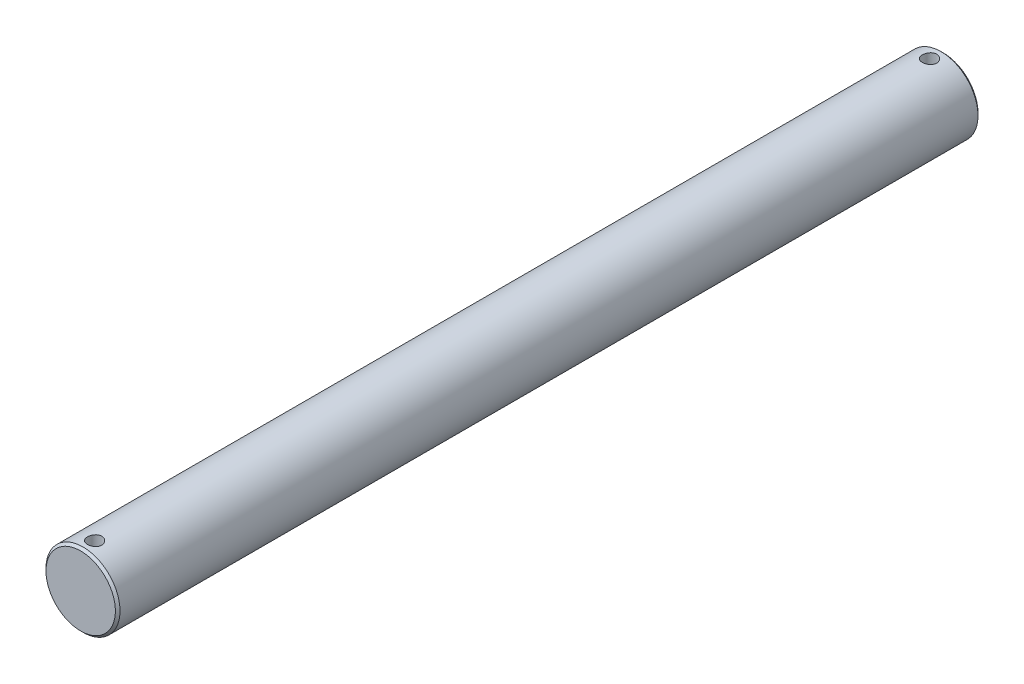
ISO-10303-21;
HEADER;
FILE_DESCRIPTION(('STEP AP214'),'2;1');
FILE_NAME('part.step','',(''),(''),'','','');
FILE_SCHEMA(('AUTOMOTIVE_DESIGN { 1 0 10303 214 1 1 1 1 }'));
ENDSEC;
DATA;
#1=APPLICATION_CONTEXT('core data for automotive mechanical design processes');
#2=APPLICATION_PROTOCOL_DEFINITION('international standard','automotive_design',2000,#1);
#3=PRODUCT_CONTEXT('',#1,'mechanical');
#4=PRODUCT('Part','Part','',(#3));
#5=PRODUCT_RELATED_PRODUCT_CATEGORY('part','',(#4));
#6=PRODUCT_DEFINITION_FORMATION('','',#4);
#7=PRODUCT_DEFINITION_CONTEXT('part definition',#1,'design');
#8=PRODUCT_DEFINITION('design','',#6,#7);
#9=PRODUCT_DEFINITION_SHAPE('','',#8);
#10=(LENGTH_UNIT() NAMED_UNIT(*) SI_UNIT(.MILLI.,.METRE.));
#11=(NAMED_UNIT(*) PLANE_ANGLE_UNIT() SI_UNIT($,.RADIAN.));
#12=(NAMED_UNIT(*) SI_UNIT($,.STERADIAN.) SOLID_ANGLE_UNIT());
#13=UNCERTAINTY_MEASURE_WITH_UNIT(LENGTH_MEASURE(1.E-05),#10,'distance_accuracy_value','');
#14=(GEOMETRIC_REPRESENTATION_CONTEXT(3) GLOBAL_UNCERTAINTY_ASSIGNED_CONTEXT((#13)) GLOBAL_UNIT_ASSIGNED_CONTEXT((#10,
#11,#12)) REPRESENTATION_CONTEXT('',''));
#15=CARTESIAN_POINT('',(0.,0.,0.));
#16=DIRECTION('',(0.,0.,1.));
#17=DIRECTION('',(1.,0.,0.));
#18=AXIS2_PLACEMENT_3D('',#15,#16,#17);
#19=CARTESIAN_POINT('',(7.5,-7.5,-186.5));
#20=DIRECTION('',(0.,0.,-1.));
#21=DIRECTION('',(-1.,0.,0.));
#22=AXIS2_PLACEMENT_3D('',#19,#20,#21);
#23=PLANE('',#22);
#24=CARTESIAN_POINT('',(0.,0.,-186.5));
#25=DIRECTION('',(0.,0.,1.));
#26=DIRECTION('',(1.,0.,0.));
#27=AXIS2_PLACEMENT_3D('',#24,#25,#26);
#28=CIRCLE('',#27,7.5);
#29=CARTESIAN_POINT('',(7.5,0.,-186.5));
#30=VERTEX_POINT('',#29);
#31=EDGE_CURVE('E76',#30,#30,#28,.F.);
#32=ORIENTED_EDGE('',*,*,#31,.T.);
#33=EDGE_LOOP('',(#32));
#34=FACE_BOUND('',#33,.T.);
#35=ADVANCED_FACE('F15',(#34),#23,.T.);
#36=CARTESIAN_POINT('',(0.,0.,-186.5));
#37=DIRECTION('',(0.,0.,1.));
#38=DIRECTION('',(1.,0.,0.));
#39=AXIS2_PLACEMENT_3D('',#36,#37,#38);
#40=CONICAL_SURFACE('',#39,7.5,0.785398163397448);
#41=ORIENTED_EDGE('',*,*,#31,.F.);
#42=EDGE_LOOP('',(#41));
#43=FACE_BOUND('',#42,.T.);
#44=CARTESIAN_POINT('',(0.,0.,-186.));
#45=DIRECTION('',(0.,0.,1.));
#46=DIRECTION('',(1.,0.,0.));
#47=AXIS2_PLACEMENT_3D('',#44,#45,#46);
#48=CIRCLE('',#47,8.);
#49=CARTESIAN_POINT('',(8.,0.,-186.));
#50=VERTEX_POINT('',#49);
#51=EDGE_CURVE('E72',#50,#50,#48,.F.);
#52=ORIENTED_EDGE('',*,*,#51,.T.);
#53=EDGE_LOOP('',(#52));
#54=FACE_BOUND('',#53,.T.);
#55=ADVANCED_FACE('F58',(#43,#54),#40,.T.);
#56=CARTESIAN_POINT('',(0.,-8.,-3.));
#57=DIRECTION('',(0.,1.,0.));
#58=DIRECTION('',(0.,0.,1.));
#59=AXIS2_PLACEMENT_3D('',#56,#57,#58);
#60=CYLINDRICAL_SURFACE('',#59,1.55);
#61=CARTESIAN_POINT('',(0.202299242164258,7.99744177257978,-1.46325831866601));
#62=CARTESIAN_POINT('',(0.26938390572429,7.99574488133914,-1.47208940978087));
#63=CARTESIAN_POINT('',(0.335867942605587,7.99321375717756,-1.48531756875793));
#64=CARTESIAN_POINT('',(0.466534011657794,7.98665328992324,-1.52032923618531));
#65=CARTESIAN_POINT('',(0.530713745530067,7.98262249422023,-1.54212104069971));
#66=CARTESIAN_POINT('',(0.655680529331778,7.97333151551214,-1.59388374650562));
#67=CARTESIAN_POINT('',(0.716463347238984,7.96806983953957,-1.62386458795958));
#68=CARTESIAN_POINT('',(0.833598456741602,7.95666903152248,-1.69149235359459));
#69=CARTESIAN_POINT('',(0.889945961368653,7.95052897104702,-1.72914740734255));
#70=CARTESIAN_POINT('',(0.997247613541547,7.93778434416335,-1.81148268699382));
#71=CARTESIAN_POINT('',(1.04819833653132,7.93117948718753,-1.85616732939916));
#72=CARTESIAN_POINT('',(1.14383347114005,7.91795286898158,-1.95180243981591));
#73=CARTESIAN_POINT('',(1.18851775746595,7.91133110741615,-2.00275303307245));
#74=CARTESIAN_POINT('',(1.27085277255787,7.89852329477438,-2.11005420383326));
#75=CARTESIAN_POINT('',(1.30850763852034,7.89233698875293,-2.16640157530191));
#76=CARTESIAN_POINT('',(1.3761351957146,7.88082669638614,-2.2835362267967));
#77=CARTESIAN_POINT('',(1.40611594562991,7.87550180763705,-2.34431876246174));
#78=CARTESIAN_POINT('',(1.45787851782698,7.86608437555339,-2.46928514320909));
#79=CARTESIAN_POINT('',(1.479670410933,7.86199031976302,-2.5334646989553));
#80=CARTESIAN_POINT('',(1.51468212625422,7.85532028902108,-2.66413087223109));
#81=CARTESIAN_POINT('',(1.52791047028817,7.85274280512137,-2.73061512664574));
#82=CARTESIAN_POINT('',(1.54556592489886,7.84928706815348,-2.86473352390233));
#83=CARTESIAN_POINT('',(1.54999998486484,7.84840747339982,-2.93236671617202));
#84=CARTESIAN_POINT('',(1.54999999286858,7.84840747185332,-3.06763308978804));
#85=CARTESIAN_POINT('',(1.54556594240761,7.84928706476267,-3.13526627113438));
#86=CARTESIAN_POINT('',(1.52791051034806,7.85274279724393,-3.26938464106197));
#87=CARTESIAN_POINT('',(1.51468218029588,7.8553202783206,-3.33586887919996));
#88=CARTESIAN_POINT('',(1.47967050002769,7.86199030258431,-3.4665350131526));
#89=CARTESIAN_POINT('',(1.45787862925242,7.86608435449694,-3.53071454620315));
#90=CARTESIAN_POINT('',(1.40611611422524,7.87550177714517,-3.65568087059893));
#91=CARTESIAN_POINT('',(1.37613540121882,7.88082666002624,-3.71646337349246));
#92=CARTESIAN_POINT('',(1.30850796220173,7.89233693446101,-3.83359790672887));
#93=CARTESIAN_POINT('',(1.27085318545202,7.8985232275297,-3.88994519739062));
#94=CARTESIAN_POINT('',(1.18851817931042,7.91133104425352,-3.9972464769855));
#95=CARTESIAN_POINT('',(1.14383378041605,7.91795282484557,-4.04819723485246));
#96=CARTESIAN_POINT('',(1.04819866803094,7.93117944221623,-4.14383235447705));
#97=CARTESIAN_POINT('',(0.997248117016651,7.93778427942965,-4.18851687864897));
#98=CARTESIAN_POINT('',(0.889946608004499,7.95052889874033,-4.27085214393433));
#99=CARTESIAN_POINT('',(0.833599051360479,7.95666896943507,-4.30850727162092));
#100=CARTESIAN_POINT('',(0.716463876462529,7.9680697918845,-4.37613513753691));
#101=CARTESIAN_POINT('',(0.655681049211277,7.97333147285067,-4.40611601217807));
#102=CARTESIAN_POINT('',(0.530714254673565,7.98262246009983,-4.4578787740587));
#103=CARTESIAN_POINT('',(0.466534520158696,7.98665325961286,-4.47967060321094));
#104=CARTESIAN_POINT('',(0.335868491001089,7.99321373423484,-4.51468230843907));
#105=CARTESIAN_POINT('',(0.269384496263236,7.99574486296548,-4.52791048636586));
#106=CARTESIAN_POINT('',(0.135266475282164,7.99913735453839,-4.54556596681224));
#107=CARTESIAN_POINT('',(0.0676333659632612,7.99999999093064,-4.54999998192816));
#108=CARTESIAN_POINT('',(-0.0676328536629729,7.99999999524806,-4.5500000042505));
#109=CARTESIAN_POINT('',(-0.135265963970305,7.9991373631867,-4.54556601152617));
#110=CARTESIAN_POINT('',(-0.269383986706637,7.995744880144,-4.52791057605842));
#111=CARTESIAN_POINT('',(-0.335867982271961,7.99321375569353,-4.51468242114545));
#112=CARTESIAN_POINT('',(-0.466534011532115,7.98665328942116,-4.47967076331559));
#113=CARTESIAN_POINT('',(-0.530713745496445,7.98262249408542,-4.45787895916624));
#114=CARTESIAN_POINT('',(-0.65568052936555,7.97333151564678,-4.4061162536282));
#115=CARTESIAN_POINT('',(-0.716463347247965,7.96806983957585,-4.37613541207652));
#116=CARTESIAN_POINT('',(-0.833598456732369,7.95666903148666,-4.30850764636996));
#117=CARTESIAN_POINT('',(-0.889945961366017,7.9505289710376,-4.27085259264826));
#118=CARTESIAN_POINT('',(-0.99724761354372,7.93778434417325,-4.18851731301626));
#119=CARTESIAN_POINT('',(-1.0481983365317,7.93117948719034,-4.1438326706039));
#120=CARTESIAN_POINT('',(-1.14383347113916,7.91795286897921,-4.04819756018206));
#121=CARTESIAN_POINT('',(-1.18851775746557,7.91133110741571,-3.99724696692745));
#122=CARTESIAN_POINT('',(-1.27085277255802,7.89852329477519,-3.8899457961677));
#123=CARTESIAN_POINT('',(-1.30850763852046,7.89233698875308,-3.83359842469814));
#124=CARTESIAN_POINT('',(-1.37613519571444,7.88082669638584,-3.716463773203));
#125=CARTESIAN_POINT('',(-1.40611594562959,7.87550180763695,-3.65568123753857));
#126=CARTESIAN_POINT('',(-1.45787851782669,7.8660843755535,-3.53071485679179));
#127=CARTESIAN_POINT('',(-1.47967041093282,7.86199031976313,-3.46653530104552));
#128=CARTESIAN_POINT('',(-1.51468212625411,7.85532028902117,-3.33586912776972));
#129=CARTESIAN_POINT('',(-1.52791047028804,7.85274280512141,-3.26938487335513));
#130=CARTESIAN_POINT('',(-1.54556592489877,7.84928706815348,-3.13526647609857));
#131=CARTESIAN_POINT('',(-1.5499999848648,7.84840747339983,-3.06763328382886));
#132=CARTESIAN_POINT('',(-1.54999999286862,7.84840747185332,-2.93236691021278));
#133=CARTESIAN_POINT('',(-1.54556594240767,7.84928706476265,-2.8647337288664));
#134=CARTESIAN_POINT('',(-1.5279105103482,7.85274279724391,-2.73061535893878));
#135=CARTESIAN_POINT('',(-1.51468218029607,7.8553202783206,-2.66413112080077));
#136=CARTESIAN_POINT('',(-1.4796705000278,7.86199030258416,-2.5334649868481));
#137=CARTESIAN_POINT('',(-1.45787862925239,7.86608435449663,-2.46928545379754));
#138=CARTESIAN_POINT('',(-1.40611611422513,7.87550177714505,-2.34431912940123));
#139=CARTESIAN_POINT('',(-1.37613540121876,7.88082666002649,-2.28353662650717));
#140=CARTESIAN_POINT('',(-1.30850796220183,7.89233693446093,-2.16640209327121));
#141=CARTESIAN_POINT('',(-1.27085318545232,7.89852322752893,-2.11005480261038));
#142=CARTESIAN_POINT('',(-1.18851817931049,7.91133104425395,-2.00275352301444));
#143=CARTESIAN_POINT('',(-1.14383378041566,7.91795282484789,-1.95180276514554));
#144=CARTESIAN_POINT('',(-1.04819866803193,7.9311794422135,-1.856167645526));
#145=CARTESIAN_POINT('',(-0.99724811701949,7.93778427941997,-1.81148312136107));
#146=CARTESIAN_POINT('',(-0.889946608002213,7.95052889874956,-1.72914785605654));
#147=CARTESIAN_POINT('',(-0.833599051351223,7.95666896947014,-1.69149272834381));
#148=CARTESIAN_POINT('',(-0.71646387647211,7.96806979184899,-1.62386486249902));
#149=CARTESIAN_POINT('',(-0.655681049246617,7.97333147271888,-1.59388398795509));
#150=CARTESIAN_POINT('',(-0.530714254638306,7.9826224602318,-1.54212122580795));
#151=CARTESIAN_POINT('',(-0.466534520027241,7.98665326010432,-1.52032939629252));
#152=CARTESIAN_POINT('',(-0.33586857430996,7.99321372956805,-1.48531771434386));
#153=CARTESIAN_POINT('',(-0.269384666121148,7.9957448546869,-1.47208954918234));
#154=CARTESIAN_POINT('',(-0.135266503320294,7.99913735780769,-1.45443402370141));
#155=CARTESIAN_POINT('',(-0.0676331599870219,8.00000000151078,-1.44999999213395));
#156=CARTESIAN_POINT('',(0.0676331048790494,7.99999999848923,-1.45000000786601));
#157=CARTESIAN_POINT('',(0.135266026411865,7.99913736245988,-1.45443400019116));
#158=CARTESIAN_POINT('',(0.202299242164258,7.99744177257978,-1.46325831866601));
#159=B_SPLINE_CURVE_WITH_KNOTS('',3,(#61,#62,#63,#64,#65,#66,#67,#68,#69,#70,#71,#72,#73,#74,
#75,#76,#77,#78,#79,#80,#81,#82,#83,#84,#85,#86,#87,#88,#89,#90,#91,#92,#93,#94,#95,#96,#97,#98,
#99,#100,#101,#102,#103,#104,#105,#106,#107,#108,#109,#110,#111,#112,#113,#114,#115,#116,#117,
#118,#119,#120,#121,#122,#123,#124,#125,#126,#127,#128,#129,#130,#131,#132,#133,#134,#135,#136,
#137,#138,#139,#140,#141,#142,#143,#144,#145,#146,#147,#148,#149,#150,#151,#152,#153,#154,#155,
#156,#157,#158),.UNSPECIFIED.,.T.,.F.,(4,2,2,2,2,2,2,2,2,2,2,2,2,2,2,2,2,2,2,2,2,2,2,2,2,2,2,2,
2,2,2,2,2,2,2,2,2,2,2,2,2,2,2,2,2,2,2,2,4),(0.,0.202904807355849,0.406006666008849,
0.609356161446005,0.812922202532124,1.01661665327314,1.22031517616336,1.42389343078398,
1.6272570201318,1.83036968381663,2.03327991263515,2.23602973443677,2.4387795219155,
2.64168969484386,2.84480227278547,3.04816572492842,3.2517436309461,3.45544274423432,
3.65913657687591,3.86270286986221,4.0660524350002,4.26915431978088,4.47205901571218,
4.67480877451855,4.87755853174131,5.0804632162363,5.28356507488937,5.48691457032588,
5.69048061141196,5.89417506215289,6.09787358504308,6.30145183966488,6.50481542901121,
6.7079280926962,6.91083832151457,7.11358814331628,7.31633793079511,7.51924810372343,
7.72236068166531,7.92572413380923,8.1293020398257,8.33300115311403,8.53669498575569,
8.74026127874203,8.94361084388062,9.14671272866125,9.34961716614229,9.55236762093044,
9.75511681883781),.UNSPECIFIED.);
#160=CARTESIAN_POINT('',(0.202299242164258,7.99744177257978,-1.46325831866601));
#161=VERTEX_POINT('',#160);
#162=EDGE_CURVE('E65',#161,#161,#159,.T.);
#163=ORIENTED_EDGE('',*,*,#162,.T.);
#164=EDGE_LOOP('',(#163));
#165=FACE_BOUND('',#164,.T.);
#166=CARTESIAN_POINT('',(-0.202299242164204,-7.99744177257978,-1.463258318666));
#167=CARTESIAN_POINT('',(-0.269383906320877,-7.99574488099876,-1.47208941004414));
#168=CARTESIAN_POINT('',(-0.335867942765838,-7.99321375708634,-1.48531756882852));
#169=CARTESIAN_POINT('',(-0.466534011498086,-7.98665329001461,-1.52032923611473));
#170=CARTESIAN_POINT('',(-0.53071374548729,-7.98262249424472,-1.54212104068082));
#171=CARTESIAN_POINT('',(-0.655680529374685,-7.9733315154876,-1.59388374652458));
#172=CARTESIAN_POINT('',(-0.716463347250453,-7.96806983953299,-1.62386458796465));
#173=CARTESIAN_POINT('',(-0.833598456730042,-7.95666903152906,-1.69149235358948));
#174=CARTESIAN_POINT('',(-0.889945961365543,-7.95052897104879,-1.72914740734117));
#175=CARTESIAN_POINT('',(-0.997247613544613,-7.93778434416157,-1.81148268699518));
#176=CARTESIAN_POINT('',(-1.0481983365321,-7.93117948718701,-1.85616732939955));
#177=CARTESIAN_POINT('',(-1.14383347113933,-7.91795286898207,-1.95180243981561));
#178=CARTESIAN_POINT('',(-1.18851775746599,-7.91133110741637,-2.00275303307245));
#179=CARTESIAN_POINT('',(-1.27085277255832,-7.89852329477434,-2.11005420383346));
#180=CARTESIAN_POINT('',(-1.30850763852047,-7.89233698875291,-2.166401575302));
#181=CARTESIAN_POINT('',(-1.37613519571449,-7.88082669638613,-2.28353622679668));
#182=CARTESIAN_POINT('',(-1.40611594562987,-7.87550180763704,-2.34431876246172));
#183=CARTESIAN_POINT('',(-1.45787851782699,-7.86608437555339,-2.46928514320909));
#184=CARTESIAN_POINT('',(-1.47967041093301,-7.86199031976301,-2.53346469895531));
#185=CARTESIAN_POINT('',(-1.51468212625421,-7.85532028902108,-2.6641308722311));
#186=CARTESIAN_POINT('',(-1.52791047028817,-7.85274280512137,-2.73061512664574));
#187=CARTESIAN_POINT('',(-1.54556592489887,-7.84928706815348,-2.86473352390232));
#188=CARTESIAN_POINT('',(-1.54999998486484,-7.84840747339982,-2.93236671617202));
#189=CARTESIAN_POINT('',(-1.54999999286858,-7.84840747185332,-3.06763308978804));
#190=CARTESIAN_POINT('',(-1.54556594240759,-7.84928706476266,-3.13526627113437));
#191=CARTESIAN_POINT('',(-1.52791051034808,-7.85274279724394,-3.26938464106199));
#192=CARTESIAN_POINT('',(-1.51468218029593,-7.85532027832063,-3.33586887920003));
#193=CARTESIAN_POINT('',(-1.47967050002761,-7.86199030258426,-3.4665350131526));
#194=CARTESIAN_POINT('',(-1.45787862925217,-7.86608435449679,-3.53071454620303));
#195=CARTESIAN_POINT('',(-1.40611611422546,-7.87550177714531,-3.65568087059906));
#196=CARTESIAN_POINT('',(-1.37613540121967,-7.88082666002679,-3.71646337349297));
#197=CARTESIAN_POINT('',(-1.3085079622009,-7.89233693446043,-3.83359790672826));
#198=CARTESIAN_POINT('',(-1.2708531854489,-7.89852322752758,-3.88994519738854));
#199=CARTESIAN_POINT('',(-1.18851817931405,-7.91133104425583,-3.99724647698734));
#200=CARTESIAN_POINT('',(-1.14383378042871,-7.91795282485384,-4.04819723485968));
#201=CARTESIAN_POINT('',(-1.04819866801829,-7.93117944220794,-4.1438323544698));
#202=CARTESIAN_POINT('',(-0.997248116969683,-7.93778427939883,-4.18851687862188));
#203=CARTESIAN_POINT('',(-0.889946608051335,-7.95052889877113,-4.27085214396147));
#204=CARTESIAN_POINT('',(-0.833599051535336,-7.95666896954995,-4.30850727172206));
#205=CARTESIAN_POINT('',(-0.716463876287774,-7.96806979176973,-4.37613513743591));
#206=CARTESIAN_POINT('',(-0.655681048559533,-7.97333147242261,-4.40611601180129));
#207=CARTESIAN_POINT('',(-0.530714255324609,-7.98262246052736,-4.45787877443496));
#208=CARTESIAN_POINT('',(-0.466534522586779,-7.98665326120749,-4.47967060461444));
#209=CARTESIAN_POINT('',(-0.335866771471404,-7.9932138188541,-4.51468276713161));
#210=CARTESIAN_POINT('',(-0.269380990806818,-7.99574499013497,-4.52791117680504));
#211=CARTESIAN_POINT('',(-0.135262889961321,-7.99913739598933,-4.54556619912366));
#212=CARTESIAN_POINT('',(-0.0676315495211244,-7.99999999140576,-4.54999998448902));
#213=CARTESIAN_POINT('',(0.0676328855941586,-7.99999999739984,-4.55000000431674));
#214=CARTESIAN_POINT('',(0.135265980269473,-7.99913736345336,-4.54556600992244));
#215=CARTESIAN_POINT('',(0.269383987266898,-7.99574487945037,-4.52791057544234));
#216=CARTESIAN_POINT('',(0.335867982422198,-7.99321375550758,-4.51468242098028));
#217=CARTESIAN_POINT('',(0.466534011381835,-7.9866532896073,-4.47967076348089));
#218=CARTESIAN_POINT('',(0.530713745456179,-7.98262249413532,-4.45787895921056));
#219=CARTESIAN_POINT('',(0.655680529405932,-7.97333151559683,-4.40611625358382));
#220=CARTESIAN_POINT('',(0.716463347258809,-7.96806983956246,-4.37613541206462));
#221=CARTESIAN_POINT('',(0.833598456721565,-7.95666903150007,-4.30850764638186));
#222=CARTESIAN_POINT('',(0.889945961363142,-7.9505289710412,-4.27085259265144));
#223=CARTESIAN_POINT('',(0.997247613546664,-7.93778434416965,-4.18851731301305));
#224=CARTESIAN_POINT('',(1.04819833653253,-7.93117948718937,-4.14383267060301));
#225=CARTESIAN_POINT('',(1.14383347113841,-7.91795286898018,-4.04819756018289));
#226=CARTESIAN_POINT('',(1.18851775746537,-7.91133110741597,-3.99724696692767));
#227=CARTESIAN_POINT('',(1.27085277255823,-7.89852329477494,-3.88994579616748));
#228=CARTESIAN_POINT('',(1.30850763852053,-7.89233698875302,-3.83359842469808));
#229=CARTESIAN_POINT('',(1.3761351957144,-7.88082669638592,-3.71646377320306));
#230=CARTESIAN_POINT('',(1.40611594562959,-7.87550180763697,-3.65568123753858));
#231=CARTESIAN_POINT('',(1.45787851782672,-7.86608437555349,-3.53071485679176));
#232=CARTESIAN_POINT('',(1.47967041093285,-7.86199031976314,-3.46653530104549));
#233=CARTESIAN_POINT('',(1.51468212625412,-7.85532028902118,-3.33586912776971));
#234=CARTESIAN_POINT('',(1.52791047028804,-7.85274280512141,-3.26938487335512));
#235=CARTESIAN_POINT('',(1.54556592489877,-7.84928706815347,-3.13526647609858));
#236=CARTESIAN_POINT('',(1.5499999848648,-7.84840747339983,-3.06763328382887));
#237=CARTESIAN_POINT('',(1.54999999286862,-7.84840747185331,-2.93236691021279));
#238=CARTESIAN_POINT('',(1.54556594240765,-7.84928706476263,-2.86473372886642));
#239=CARTESIAN_POINT('',(1.52791051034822,-7.85274279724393,-2.73061535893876));
#240=CARTESIAN_POINT('',(1.51468218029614,-7.85532027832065,-2.66413112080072));
#241=CARTESIAN_POINT('',(1.47967050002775,-7.86199030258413,-2.53346498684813));
#242=CARTESIAN_POINT('',(1.45787862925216,-7.86608435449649,-2.46928545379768));
#243=CARTESIAN_POINT('',(1.4061161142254,-7.8755017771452,-2.34431912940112));
#244=CARTESIAN_POINT('',(1.37613540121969,-7.88082666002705,-2.28353662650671));
#245=CARTESIAN_POINT('',(1.30850796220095,-7.89233693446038,-2.16640209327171));
#246=CARTESIAN_POINT('',(1.27085318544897,-7.89852322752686,-2.1100548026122));
#247=CARTESIAN_POINT('',(1.18851817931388,-7.91133104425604,-2.00275352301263));
#248=CARTESIAN_POINT('',(1.14383378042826,-7.91795282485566,-1.95180276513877));
#249=CARTESIAN_POINT('',(1.04819866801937,-7.93117944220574,-1.85616764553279));
#250=CARTESIAN_POINT('',(0.997248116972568,-7.93778427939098,-1.81148312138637));
#251=CARTESIAN_POINT('',(0.889946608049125,-7.95052889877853,-1.72914785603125));
#252=CARTESIAN_POINT('',(0.83359905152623,-7.95666896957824,-1.69149272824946));
#253=CARTESIAN_POINT('',(0.716463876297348,-7.96806979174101,-1.62386486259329));
#254=CARTESIAN_POINT('',(0.655681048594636,-7.97333147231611,-1.5938839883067));
#255=CARTESIAN_POINT('',(0.53071425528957,-7.98262246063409,-1.54212122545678));
#256=CARTESIAN_POINT('',(0.466534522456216,-7.98665326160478,-1.5203293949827));
#257=CARTESIAN_POINT('',(0.335866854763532,-7.99321381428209,-1.48531725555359));
#258=CARTESIAN_POINT('',(0.269381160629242,-7.9957449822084,-1.47208885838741));
#259=CARTESIAN_POINT('',(0.13526293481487,-7.99913739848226,-1.45443379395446));
#260=CARTESIAN_POINT('',(0.0676313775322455,-8.00000000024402,-1.44999999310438));
#261=CARTESIAN_POINT('',(-0.0676331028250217,-7.99999999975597,-1.45000000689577));
#262=CARTESIAN_POINT('',(-0.135266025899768,-7.99913736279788,-1.45443399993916));
#263=CARTESIAN_POINT('',(-0.202299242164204,-7.99744177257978,-1.463258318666));
#264=B_SPLINE_CURVE_WITH_KNOTS('',3,(#166,#167,#168,#169,#170,#171,#172,#173,#174,#175,#176,
#177,#178,#179,#180,#181,#182,#183,#184,#185,#186,#187,#188,#189,#190,#191,#192,#193,#194,#195,
#196,#197,#198,#199,#200,#201,#202,#203,#204,#205,#206,#207,#208,#209,#210,#211,#212,#213,#214,
#215,#216,#217,#218,#219,#220,#221,#222,#223,#224,#225,#226,#227,#228,#229,#230,#231,#232,#233,
#234,#235,#236,#237,#238,#239,#240,#241,#242,#243,#244,#245,#246,#247,#248,#249,#250,#251,#252,
#253,#254,#255,#256,#257,#258,#259,#260,#261,#262,#263),.UNSPECIFIED.,.T.,.F.,(4,2,2,2,2,2,2,2,
2,2,2,2,2,2,2,2,2,2,2,2,2,2,2,2,2,2,2,2,2,2,2,2,2,2,2,2,2,2,2,2,2,2,2,2,2,2,2,2,4),(0.,
0.202904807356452,0.406006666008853,0.609356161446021,0.812922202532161,1.0166166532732,
1.22031517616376,1.42389343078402,1.62725702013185,1.83036968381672,2.03327991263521,
2.23602973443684,2.43877952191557,2.64168969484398,2.84480227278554,3.0481657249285,
3.25174363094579,3.45544274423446,3.65913657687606,3.86270286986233,4.06605243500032,
4.26915431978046,4.47206435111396,4.67480882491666,4.87755853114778,5.0804632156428,
5.28356507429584,5.48691456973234,5.69048061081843,5.89417506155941,6.09787358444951,
6.30145183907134,6.50481542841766,6.70792809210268,6.91083832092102,7.11358814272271,
7.31633793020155,7.5192481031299,7.72236068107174,7.92572413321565,8.12930203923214,
8.33300115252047,8.53669498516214,8.74026127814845,8.94361084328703,9.1467127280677,
9.34962250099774,9.55236761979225,9.75511681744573),.UNSPECIFIED.);
#265=CARTESIAN_POINT('',(-0.202299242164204,-7.99744177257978,-1.463258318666));
#266=VERTEX_POINT('',#265);
#267=EDGE_CURVE('E62',#266,#266,#264,.T.);
#268=ORIENTED_EDGE('',*,*,#267,.T.);
#269=EDGE_LOOP('',(#268));
#270=FACE_BOUND('',#269,.T.);
#271=ADVANCED_FACE('F52',(#165,#270),#60,.F.);
#272=CARTESIAN_POINT('',(0.,-8.,-183.5));
#273=DIRECTION('',(0.,1.,0.));
#274=DIRECTION('',(0.,0.,1.));
#275=AXIS2_PLACEMENT_3D('',#272,#273,#274);
#276=CYLINDRICAL_SURFACE('',#275,1.54999999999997);
#277=CARTESIAN_POINT('',(0.202299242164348,7.99744177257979,-181.963258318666));
#278=CARTESIAN_POINT('',(0.269383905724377,7.99574488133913,-181.972089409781));
#279=CARTESIAN_POINT('',(0.335867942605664,7.99321375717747,-181.985317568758));
#280=CARTESIAN_POINT('',(0.466534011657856,7.98665328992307,-182.020329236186));
#281=CARTESIAN_POINT('',(0.530713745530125,7.98262249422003,-182.0421210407));
#282=CARTESIAN_POINT('',(0.655680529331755,7.97333151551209,-182.093883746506));
#283=CARTESIAN_POINT('',(0.716463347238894,7.9680698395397,-182.123864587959));
#284=CARTESIAN_POINT('',(0.833598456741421,7.95666903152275,-182.191492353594));
#285=CARTESIAN_POINT('',(0.889945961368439,7.95052897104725,-182.229147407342));
#286=CARTESIAN_POINT('',(0.997247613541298,7.93778434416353,-182.311482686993));
#287=CARTESIAN_POINT('',(1.04819833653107,7.93117948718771,-182.356167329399));
#288=CARTESIAN_POINT('',(1.14383347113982,7.91795286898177,-182.451802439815));
#289=CARTESIAN_POINT('',(1.18851775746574,7.91133110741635,-182.502753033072));
#290=CARTESIAN_POINT('',(1.27085277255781,7.89852329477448,-182.610054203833));
#291=CARTESIAN_POINT('',(1.30850763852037,7.89233698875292,-182.666401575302));
#292=CARTESIAN_POINT('',(1.37613519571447,7.88082669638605,-182.783536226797));
#293=CARTESIAN_POINT('',(1.4061159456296,7.87550180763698,-182.844318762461));
#294=CARTESIAN_POINT('',(1.45787851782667,7.86608437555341,-182.969285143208));
#295=CARTESIAN_POINT('',(1.47967041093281,7.8619903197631,-183.033464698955));
#296=CARTESIAN_POINT('',(1.51468212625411,7.85532028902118,-183.16413087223));
#297=CARTESIAN_POINT('',(1.52791047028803,7.85274280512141,-183.230615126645));
#298=CARTESIAN_POINT('',(1.54556592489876,7.84928706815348,-183.364733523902));
#299=CARTESIAN_POINT('',(1.54999998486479,7.84840747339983,-183.432366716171));
#300=CARTESIAN_POINT('',(1.54999999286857,7.84840747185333,-183.567633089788));
#301=CARTESIAN_POINT('',(1.54556594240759,7.84928706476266,-183.635266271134));
#302=CARTESIAN_POINT('',(1.52791051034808,7.85274279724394,-183.769384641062));
#303=CARTESIAN_POINT('',(1.51468218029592,7.85532027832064,-183.8358688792));
#304=CARTESIAN_POINT('',(1.47967050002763,7.86199030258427,-183.966535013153));
#305=CARTESIAN_POINT('',(1.45787862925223,7.86608435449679,-184.030714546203));
#306=CARTESIAN_POINT('',(1.40611611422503,7.87550177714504,-184.155680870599));
#307=CARTESIAN_POINT('',(1.37613540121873,7.88082666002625,-184.216463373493));
#308=CARTESIAN_POINT('',(1.30850796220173,7.89233693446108,-184.333597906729));
#309=CARTESIAN_POINT('',(1.27085318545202,7.89852322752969,-184.389945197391));
#310=CARTESIAN_POINT('',(1.18851817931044,7.91133104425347,-184.497246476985));
#311=CARTESIAN_POINT('',(1.14383378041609,7.91795282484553,-184.548197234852));
#312=CARTESIAN_POINT('',(1.04819866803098,7.93117944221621,-184.643832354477));
#313=CARTESIAN_POINT('',(0.997248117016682,7.93778427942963,-184.688516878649));
#314=CARTESIAN_POINT('',(0.889946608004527,7.95052889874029,-184.770852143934));
#315=CARTESIAN_POINT('',(0.833599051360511,7.95666896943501,-184.808507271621));
#316=CARTESIAN_POINT('',(0.716463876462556,7.96806979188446,-184.876135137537));
#317=CARTESIAN_POINT('',(0.655681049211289,7.97333147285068,-184.906116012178));
#318=CARTESIAN_POINT('',(0.530714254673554,7.98262246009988,-184.957878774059));
#319=CARTESIAN_POINT('',(0.466534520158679,7.98665325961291,-184.979670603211));
#320=CARTESIAN_POINT('',(0.335868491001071,7.99321373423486,-185.014682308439));
#321=CARTESIAN_POINT('',(0.269384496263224,7.99574486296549,-185.027910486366));
#322=CARTESIAN_POINT('',(0.135266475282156,7.99913735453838,-185.045565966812));
#323=CARTESIAN_POINT('',(0.0676333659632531,7.99999999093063,-185.049999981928));
#324=CARTESIAN_POINT('',(-0.0676328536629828,7.99999999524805,-185.05000000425));
#325=CARTESIAN_POINT('',(-0.135265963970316,7.9991373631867,-185.045566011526));
#326=CARTESIAN_POINT('',(-0.269383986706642,7.99574488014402,-185.027910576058));
#327=CARTESIAN_POINT('',(-0.335867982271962,7.99321375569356,-185.014682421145));
#328=CARTESIAN_POINT('',(-0.466534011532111,7.98665328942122,-184.979670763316));
#329=CARTESIAN_POINT('',(-0.530713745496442,7.98262249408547,-184.957878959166));
#330=CARTESIAN_POINT('',(-0.655680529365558,7.97333151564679,-184.906116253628));
#331=CARTESIAN_POINT('',(-0.716463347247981,7.96806983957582,-184.876135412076));
#332=CARTESIAN_POINT('',(-0.833598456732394,7.9566690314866,-184.80850764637));
#333=CARTESIAN_POINT('',(-0.889945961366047,7.95052897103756,-184.770852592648));
#334=CARTESIAN_POINT('',(-0.997247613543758,7.93778434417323,-184.688517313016));
#335=CARTESIAN_POINT('',(-1.04819833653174,7.93117948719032,-184.643832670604));
#336=CARTESIAN_POINT('',(-1.14383347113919,7.91795286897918,-184.548197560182));
#337=CARTESIAN_POINT('',(-1.1885177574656,7.91133110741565,-184.497246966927));
#338=CARTESIAN_POINT('',(-1.27085277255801,7.89852329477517,-184.389945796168));
#339=CARTESIAN_POINT('',(-1.30850763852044,7.89233698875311,-184.333598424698));
#340=CARTESIAN_POINT('',(-1.37613519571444,7.88082669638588,-184.216463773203));
#341=CARTESIAN_POINT('',(-1.4061159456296,7.87550180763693,-184.155681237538));
#342=CARTESIAN_POINT('',(-1.45787851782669,7.86608437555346,-184.030714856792));
#343=CARTESIAN_POINT('',(-1.47967041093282,7.86199031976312,-183.966535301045));
#344=CARTESIAN_POINT('',(-1.51468212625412,7.85532028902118,-183.83586912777));
#345=CARTESIAN_POINT('',(-1.52791047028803,7.85274280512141,-183.769384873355));
#346=CARTESIAN_POINT('',(-1.54556592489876,7.84928706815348,-183.635266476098));
#347=CARTESIAN_POINT('',(-1.54999998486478,7.84840747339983,-183.567633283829));
#348=CARTESIAN_POINT('',(-1.54999999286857,7.84840747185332,-183.432366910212));
#349=CARTESIAN_POINT('',(-1.54556594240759,7.84928706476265,-183.364733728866));
#350=CARTESIAN_POINT('',(-1.52791051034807,7.85274279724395,-183.230615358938));
#351=CARTESIAN_POINT('',(-1.51468218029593,7.85532027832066,-183.1641311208));
#352=CARTESIAN_POINT('',(-1.47967050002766,7.86199030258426,-183.033464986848));
#353=CARTESIAN_POINT('',(-1.45787862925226,7.86608435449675,-182.969285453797));
#354=CARTESIAN_POINT('',(-1.40611611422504,7.87550177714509,-182.844319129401));
#355=CARTESIAN_POINT('',(-1.37613540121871,7.88082666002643,-182.783536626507));
#356=CARTESIAN_POINT('',(-1.30850796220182,7.89233693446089,-182.666402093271));
#357=CARTESIAN_POINT('',(-1.27085318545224,7.89852322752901,-182.61005480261));
#358=CARTESIAN_POINT('',(-1.18851817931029,7.91133104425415,-182.502753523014));
#359=CARTESIAN_POINT('',(-1.14383378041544,7.91795282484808,-182.451802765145));
#360=CARTESIAN_POINT('',(-1.04819866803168,7.93117944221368,-182.356167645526));
#361=CARTESIAN_POINT('',(-0.997248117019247,7.93778427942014,-182.311483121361));
#362=CARTESIAN_POINT('',(-0.889946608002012,7.95052889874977,-182.229147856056));
#363=CARTESIAN_POINT('',(-0.83359905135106,7.9566689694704,-182.191492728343));
#364=CARTESIAN_POINT('',(-0.716463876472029,7.96806979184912,-182.123864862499));
#365=CARTESIAN_POINT('',(-0.655681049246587,7.97333147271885,-182.093883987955));
#366=CARTESIAN_POINT('',(-0.530714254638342,7.98262246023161,-182.042121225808));
#367=CARTESIAN_POINT('',(-0.46653452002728,7.98665326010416,-182.020329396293));
#368=CARTESIAN_POINT('',(-0.335868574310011,7.99321372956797,-181.985317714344));
#369=CARTESIAN_POINT('',(-0.269384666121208,7.99574485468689,-181.972089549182));
#370=CARTESIAN_POINT('',(-0.135266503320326,7.99913735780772,-181.954434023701));
#371=CARTESIAN_POINT('',(-0.0676331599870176,8.00000000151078,-181.949999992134));
#372=CARTESIAN_POINT('',(0.0676331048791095,7.99999999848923,-181.950000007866));
#373=CARTESIAN_POINT('',(0.135266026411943,7.9991373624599,-181.954434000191));
#374=CARTESIAN_POINT('',(0.202299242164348,7.99744177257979,-181.963258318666));
#375=B_SPLINE_CURVE_WITH_KNOTS('',3,(#277,#278,#279,#280,#281,#282,#283,#284,#285,#286,#287,
#288,#289,#290,#291,#292,#293,#294,#295,#296,#297,#298,#299,#300,#301,#302,#303,#304,#305,#306,
#307,#308,#309,#310,#311,#312,#313,#314,#315,#316,#317,#318,#319,#320,#321,#322,#323,#324,#325,
#326,#327,#328,#329,#330,#331,#332,#333,#334,#335,#336,#337,#338,#339,#340,#341,#342,#343,#344,
#345,#346,#347,#348,#349,#350,#351,#352,#353,#354,#355,#356,#357,#358,#359,#360,#361,#362,#363,
#364,#365,#366,#367,#368,#369,#370,#371,#372,#373,#374),.UNSPECIFIED.,.T.,.F.,(4,2,2,2,2,2,2,2,
2,2,2,2,2,2,2,2,2,2,2,2,2,2,2,2,2,2,2,2,2,2,2,2,2,2,2,2,2,2,2,2,2,2,2,2,2,2,2,2,4),(0.,
0.202904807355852,0.406006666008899,0.609356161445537,0.812922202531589,1.01661665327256,
1.22031517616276,1.42389343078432,1.62725702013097,1.83036968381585,2.03327991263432,
2.23602973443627,2.43877952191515,2.64168969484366,2.84480227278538,3.04816572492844,
3.2517436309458,3.45544274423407,3.65913657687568,3.86270286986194,4.06605243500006,
4.26915431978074,4.47205901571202,4.67480877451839,4.87755853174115,5.08046321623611,
5.28356507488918,5.48691457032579,5.69048061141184,5.89417506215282,6.09787358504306,
6.30145183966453,6.5048154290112,6.70792809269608,6.91083832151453,7.11358814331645,
7.31633793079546,7.51924810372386,7.72236068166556,7.92572413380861,8.12930203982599,
8.3330011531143,8.5366949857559,8.74026127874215,8.94361084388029,9.14671272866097,
9.34961716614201,9.55236762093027,9.75511681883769),.UNSPECIFIED.);
#376=CARTESIAN_POINT('',(0.202299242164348,7.99744177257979,-181.963258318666));
#377=VERTEX_POINT('',#376);
#378=EDGE_CURVE('E41',#377,#377,#375,.T.);
#379=ORIENTED_EDGE('',*,*,#378,.T.);
#380=EDGE_LOOP('',(#379));
#381=FACE_BOUND('',#380,.T.);
#382=CARTESIAN_POINT('',(-0.202299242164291,-7.99744177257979,-181.963258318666));
#383=CARTESIAN_POINT('',(-0.269383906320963,-7.99574488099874,-181.972089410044));
#384=CARTESIAN_POINT('',(-0.335867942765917,-7.99321375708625,-181.985317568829));
#385=CARTESIAN_POINT('',(-0.46653401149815,-7.98665329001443,-182.020329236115));
#386=CARTESIAN_POINT('',(-0.530713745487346,-7.98262249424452,-182.042121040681));
#387=CARTESIAN_POINT('',(-0.655680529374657,-7.97333151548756,-182.093883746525));
#388=CARTESIAN_POINT('',(-0.71646334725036,-7.96806983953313,-182.123864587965));
#389=CARTESIAN_POINT('',(-0.833598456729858,-7.95666903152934,-182.191492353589));
#390=CARTESIAN_POINT('',(-0.889945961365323,-7.95052897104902,-182.229147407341));
#391=CARTESIAN_POINT('',(-0.997247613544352,-7.93778434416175,-182.311482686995));
#392=CARTESIAN_POINT('',(-1.04819833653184,-7.9311794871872,-182.356167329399));
#393=CARTESIAN_POINT('',(-1.14383347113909,-7.91795286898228,-182.451802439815));
#394=CARTESIAN_POINT('',(-1.18851775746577,-7.91133110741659,-182.502753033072));
#395=CARTESIAN_POINT('',(-1.27085277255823,-7.89852329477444,-182.610054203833));
#396=CARTESIAN_POINT('',(-1.30850763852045,-7.89233698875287,-182.666401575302));
#397=CARTESIAN_POINT('',(-1.37613519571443,-7.88082669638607,-182.783536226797));
#398=CARTESIAN_POINT('',(-1.40611594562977,-7.87550180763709,-182.844318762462));
#399=CARTESIAN_POINT('',(-1.45787851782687,-7.86608437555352,-182.969285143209));
#400=CARTESIAN_POINT('',(-1.47967041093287,-7.86199031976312,-183.033464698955));
#401=CARTESIAN_POINT('',(-1.51468212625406,-7.85532028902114,-183.16413087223));
#402=CARTESIAN_POINT('',(-1.52791047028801,-7.85274280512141,-183.230615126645));
#403=CARTESIAN_POINT('',(-1.54556592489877,-7.84928706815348,-183.364733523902));
#404=CARTESIAN_POINT('',(-1.54999998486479,-7.84840747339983,-183.432366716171));
#405=CARTESIAN_POINT('',(-1.54999999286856,-7.84840747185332,-183.567633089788));
#406=CARTESIAN_POINT('',(-1.54556594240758,-7.84928706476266,-183.635266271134));
#407=CARTESIAN_POINT('',(-1.52791051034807,-7.85274279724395,-183.769384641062));
#408=CARTESIAN_POINT('',(-1.51468218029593,-7.85532027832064,-183.8358688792));
#409=CARTESIAN_POINT('',(-1.47967050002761,-7.86199030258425,-183.966535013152));
#410=CARTESIAN_POINT('',(-1.45787862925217,-7.86608435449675,-184.030714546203));
#411=CARTESIAN_POINT('',(-1.40611611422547,-7.87550177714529,-184.155680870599));
#412=CARTESIAN_POINT('',(-1.37613540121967,-7.88082666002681,-184.216463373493));
#413=CARTESIAN_POINT('',(-1.30850796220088,-7.89233693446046,-184.333597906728));
#414=CARTESIAN_POINT('',(-1.2708531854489,-7.89852322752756,-184.389945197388));
#415=CARTESIAN_POINT('',(-1.18851817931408,-7.91133104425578,-184.497246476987));
#416=CARTESIAN_POINT('',(-1.14383378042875,-7.91795282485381,-184.54819723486));
#417=CARTESIAN_POINT('',(-1.04819866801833,-7.93117944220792,-184.64383235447));
#418=CARTESIAN_POINT('',(-0.997248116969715,-7.93778427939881,-184.688516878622));
#419=CARTESIAN_POINT('',(-0.889946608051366,-7.95052889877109,-184.770852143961));
#420=CARTESIAN_POINT('',(-0.833599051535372,-7.95666896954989,-184.808507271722));
#421=CARTESIAN_POINT('',(-0.716463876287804,-7.9680697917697,-184.876135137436));
#422=CARTESIAN_POINT('',(-0.655681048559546,-7.97333147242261,-184.906116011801));
#423=CARTESIAN_POINT('',(-0.530714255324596,-7.98262246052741,-184.957878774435));
#424=CARTESIAN_POINT('',(-0.466534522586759,-7.98665326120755,-184.979670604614));
#425=CARTESIAN_POINT('',(-0.335866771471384,-7.99321381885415,-185.014682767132));
#426=CARTESIAN_POINT('',(-0.269380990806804,-7.99574499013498,-185.027911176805));
#427=CARTESIAN_POINT('',(-0.135262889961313,-7.99913739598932,-185.045566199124));
#428=CARTESIAN_POINT('',(-0.0676315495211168,-7.99999999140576,-185.049999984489));
#429=CARTESIAN_POINT('',(0.0676328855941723,-7.99999999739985,-185.050000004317));
#430=CARTESIAN_POINT('',(0.135265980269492,-7.99913736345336,-185.045566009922));
#431=CARTESIAN_POINT('',(0.269383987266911,-7.99574487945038,-185.027910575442));
#432=CARTESIAN_POINT('',(0.3358679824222,-7.99321375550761,-185.01468242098));
#433=CARTESIAN_POINT('',(0.466534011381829,-7.98665328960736,-184.979670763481));
#434=CARTESIAN_POINT('',(0.530713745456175,-7.98262249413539,-184.957878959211));
#435=CARTESIAN_POINT('',(0.655680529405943,-7.97333151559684,-184.906116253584));
#436=CARTESIAN_POINT('',(0.71646334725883,-7.96806983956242,-184.876135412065));
#437=CARTESIAN_POINT('',(0.833598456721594,-7.95666903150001,-184.808507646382));
#438=CARTESIAN_POINT('',(0.889945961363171,-7.95052897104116,-184.770852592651));
#439=CARTESIAN_POINT('',(0.997247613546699,-7.93778434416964,-184.688517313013));
#440=CARTESIAN_POINT('',(1.04819833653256,-7.93117948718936,-184.643832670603));
#441=CARTESIAN_POINT('',(1.14383347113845,-7.91795286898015,-184.548197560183));
#442=CARTESIAN_POINT('',(1.1885177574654,-7.91133110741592,-184.497246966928));
#443=CARTESIAN_POINT('',(1.27085277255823,-7.89852329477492,-184.389945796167));
#444=CARTESIAN_POINT('',(1.30850763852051,-7.89233698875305,-184.333598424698));
#445=CARTESIAN_POINT('',(1.3761351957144,-7.88082669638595,-184.216463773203));
#446=CARTESIAN_POINT('',(1.4061159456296,-7.87550180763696,-184.155681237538));
#447=CARTESIAN_POINT('',(1.45787851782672,-7.86608437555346,-184.030714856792));
#448=CARTESIAN_POINT('',(1.47967041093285,-7.86199031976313,-183.966535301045));
#449=CARTESIAN_POINT('',(1.51468212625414,-7.85532028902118,-183.83586912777));
#450=CARTESIAN_POINT('',(1.52791047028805,-7.85274280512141,-183.769384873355));
#451=CARTESIAN_POINT('',(1.54556592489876,-7.84928706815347,-183.635266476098));
#452=CARTESIAN_POINT('',(1.54999998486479,-7.84840747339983,-183.567633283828));
#453=CARTESIAN_POINT('',(1.54999999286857,-7.84840747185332,-183.432366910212));
#454=CARTESIAN_POINT('',(1.54556594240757,-7.84928706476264,-183.364733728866));
#455=CARTESIAN_POINT('',(1.52791051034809,-7.85274279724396,-183.230615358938));
#456=CARTESIAN_POINT('',(1.514682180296,-7.8553202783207,-183.1641311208));
#457=CARTESIAN_POINT('',(1.47967050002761,-7.86199030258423,-183.033464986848));
#458=CARTESIAN_POINT('',(1.45787862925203,-7.86608435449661,-182.969285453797));
#459=CARTESIAN_POINT('',(1.4061161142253,-7.87550177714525,-182.844319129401));
#460=CARTESIAN_POINT('',(1.37613540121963,-7.88082666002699,-182.783536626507));
#461=CARTESIAN_POINT('',(1.30850796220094,-7.89233693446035,-182.666402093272));
#462=CARTESIAN_POINT('',(1.2708531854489,-7.89852322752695,-182.610054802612));
#463=CARTESIAN_POINT('',(1.18851817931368,-7.91133104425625,-182.502753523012));
#464=CARTESIAN_POINT('',(1.14383378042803,-7.91795282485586,-182.451802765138));
#465=CARTESIAN_POINT('',(1.04819866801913,-7.93117944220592,-182.356167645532));
#466=CARTESIAN_POINT('',(0.997248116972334,-7.93778427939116,-182.311483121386));
#467=CARTESIAN_POINT('',(0.889946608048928,-7.95052889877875,-182.229147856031));
#468=CARTESIAN_POINT('',(0.833599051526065,-7.9566689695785,-182.191492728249));
#469=CARTESIAN_POINT('',(0.716463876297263,-7.96806979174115,-182.123864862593));
#470=CARTESIAN_POINT('',(0.655681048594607,-7.97333147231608,-182.093883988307));
#471=CARTESIAN_POINT('',(0.53071425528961,-7.98262246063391,-182.042121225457));
#472=CARTESIAN_POINT('',(0.46653452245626,-7.98665326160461,-182.020329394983));
#473=CARTESIAN_POINT('',(0.33586685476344,-7.99321381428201,-181.985317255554));
#474=CARTESIAN_POINT('',(0.269381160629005,-7.99574498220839,-181.972088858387));
#475=CARTESIAN_POINT('',(0.13526293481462,-7.99913739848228,-181.954433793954));
#476=CARTESIAN_POINT('',(0.0676313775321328,-8.00000000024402,-181.949999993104));
#477=CARTESIAN_POINT('',(-0.0676331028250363,-7.99999999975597,-181.950000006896));
#478=CARTESIAN_POINT('',(-0.135266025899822,-7.9991373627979,-181.954433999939));
#479=CARTESIAN_POINT('',(-0.202299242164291,-7.99744177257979,-181.963258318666));
#480=B_SPLINE_CURVE_WITH_KNOTS('',3,(#382,#383,#384,#385,#386,#387,#388,#389,#390,#391,#392,
#393,#394,#395,#396,#397,#398,#399,#400,#401,#402,#403,#404,#405,#406,#407,#408,#409,#410,#411,
#412,#413,#414,#415,#416,#417,#418,#419,#420,#421,#422,#423,#424,#425,#426,#427,#428,#429,#430,
#431,#432,#433,#434,#435,#436,#437,#438,#439,#440,#441,#442,#443,#444,#445,#446,#447,#448,#449,
#450,#451,#452,#453,#454,#455,#456,#457,#458,#459,#460,#461,#462,#463,#464,#465,#466,#467,#468,
#469,#470,#471,#472,#473,#474,#475,#476,#477,#478,#479),.UNSPECIFIED.,.T.,.F.,(4,2,2,2,2,2,2,2,
2,2,2,2,2,2,2,2,2,2,2,2,2,2,2,2,2,2,2,2,2,2,2,2,2,2,2,2,2,2,2,2,2,2,2,2,2,2,2,2,4),(0.,
0.202904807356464,0.406006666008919,0.609356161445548,0.812922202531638,1.01661665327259,
1.22031517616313,1.42389343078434,1.62725702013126,1.83036968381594,2.03327991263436,
2.23602973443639,2.43877952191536,2.64168969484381,2.8448022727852,3.04816572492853,
3.25174363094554,3.45544274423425,3.65913657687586,3.86270286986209,4.06605243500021,
4.26915431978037,4.47206435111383,4.67480882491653,4.87755853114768,5.08046321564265,
5.28356507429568,5.48691456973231,5.69048061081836,5.89417506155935,6.09787358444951,
6.30145183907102,6.50481542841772,6.7079280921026,6.91083832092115,7.1135881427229,
7.31633793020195,7.51924810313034,7.72236068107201,7.92572413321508,8.12930203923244,
8.33300115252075,8.53669498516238,8.74026127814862,8.94361084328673,9.14671272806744,
9.34962250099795,9.55236761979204,9.75511681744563),.UNSPECIFIED.);
#481=CARTESIAN_POINT('',(-0.202299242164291,-7.99744177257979,-181.963258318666));
#482=VERTEX_POINT('',#481);
#483=EDGE_CURVE('E28',#482,#482,#480,.T.);
#484=ORIENTED_EDGE('',*,*,#483,.T.);
#485=EDGE_LOOP('',(#484));
#486=FACE_BOUND('',#485,.T.);
#487=ADVANCED_FACE('F48',(#381,#486),#276,.F.);
#488=CARTESIAN_POINT('',(0.,0.,-186.));
#489=DIRECTION('',(0.,0.,1.));
#490=DIRECTION('',(1.,0.,0.));
#491=AXIS2_PLACEMENT_3D('',#488,#489,#490);
#492=CYLINDRICAL_SURFACE('',#491,8.);
#493=ORIENTED_EDGE('',*,*,#51,.F.);
#494=EDGE_LOOP('',(#493));
#495=FACE_BOUND('',#494,.T.);
#496=ORIENTED_EDGE('',*,*,#483,.F.);
#497=EDGE_LOOP('',(#496));
#498=FACE_BOUND('',#497,.T.);
#499=ORIENTED_EDGE('',*,*,#378,.F.);
#500=EDGE_LOOP('',(#499));
#501=FACE_BOUND('',#500,.T.);
#502=ORIENTED_EDGE('',*,*,#162,.F.);
#503=EDGE_LOOP('',(#502));
#504=FACE_BOUND('',#503,.T.);
#505=ORIENTED_EDGE('',*,*,#267,.F.);
#506=EDGE_LOOP('',(#505));
#507=FACE_BOUND('',#506,.T.);
#508=CARTESIAN_POINT('',(0.,0.,-0.5));
#509=DIRECTION('',(0.,0.,1.));
#510=DIRECTION('',(1.,0.,0.));
#511=AXIS2_PLACEMENT_3D('',#508,#509,#510);
#512=CIRCLE('',#511,8.);
#513=CARTESIAN_POINT('',(8.,0.,-0.5));
#514=VERTEX_POINT('',#513);
#515=EDGE_CURVE('E23',#514,#514,#512,.F.);
#516=ORIENTED_EDGE('',*,*,#515,.T.);
#517=EDGE_LOOP('',(#516));
#518=FACE_BOUND('',#517,.T.);
#519=ADVANCED_FACE('F45',(#495,#498,#501,#504,#507,#518),#492,.T.);
#520=CARTESIAN_POINT('',(0.,0.,-0.5));
#521=DIRECTION('',(0.,0.,-1.));
#522=DIRECTION('',(-1.,0.,0.));
#523=AXIS2_PLACEMENT_3D('',#520,#521,#522);
#524=CONICAL_SURFACE('',#523,8.,0.785398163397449);
#525=ORIENTED_EDGE('',*,*,#515,.F.);
#526=EDGE_LOOP('',(#525));
#527=FACE_BOUND('',#526,.T.);
#528=CARTESIAN_POINT('',(0.,0.,0.));
#529=DIRECTION('',(0.,0.,-1.));
#530=DIRECTION('',(-1.,0.,0.));
#531=AXIS2_PLACEMENT_3D('',#528,#529,#530);
#532=CIRCLE('',#531,7.5);
#533=CARTESIAN_POINT('',(-7.5,0.,0.));
#534=VERTEX_POINT('',#533);
#535=EDGE_CURVE('E10',#534,#534,#532,.F.);
#536=ORIENTED_EDGE('',*,*,#535,.F.);
#537=EDGE_LOOP('',(#536));
#538=FACE_BOUND('',#537,.T.);
#539=ADVANCED_FACE('F92',(#527,#538),#524,.T.);
#540=CARTESIAN_POINT('',(-7.5,-7.5,0.));
#541=DIRECTION('',(0.,0.,1.));
#542=DIRECTION('',(1.,0.,0.));
#543=AXIS2_PLACEMENT_3D('',#540,#541,#542);
#544=PLANE('',#543);
#545=ORIENTED_EDGE('',*,*,#535,.T.);
#546=EDGE_LOOP('',(#545));
#547=FACE_BOUND('',#546,.T.);
#548=ADVANCED_FACE('F17',(#547),#544,.T.);
#549=CLOSED_SHELL('',(#35,#55,#271,#487,#519,#539,#548));
#550=MANIFOLD_SOLID_BREP('B1',#549);
#551=ADVANCED_BREP_SHAPE_REPRESENTATION('',(#18,#550),#14);
#552=SHAPE_DEFINITION_REPRESENTATION(#9,#551);
ENDSEC;
END-ISO-10303-21;
